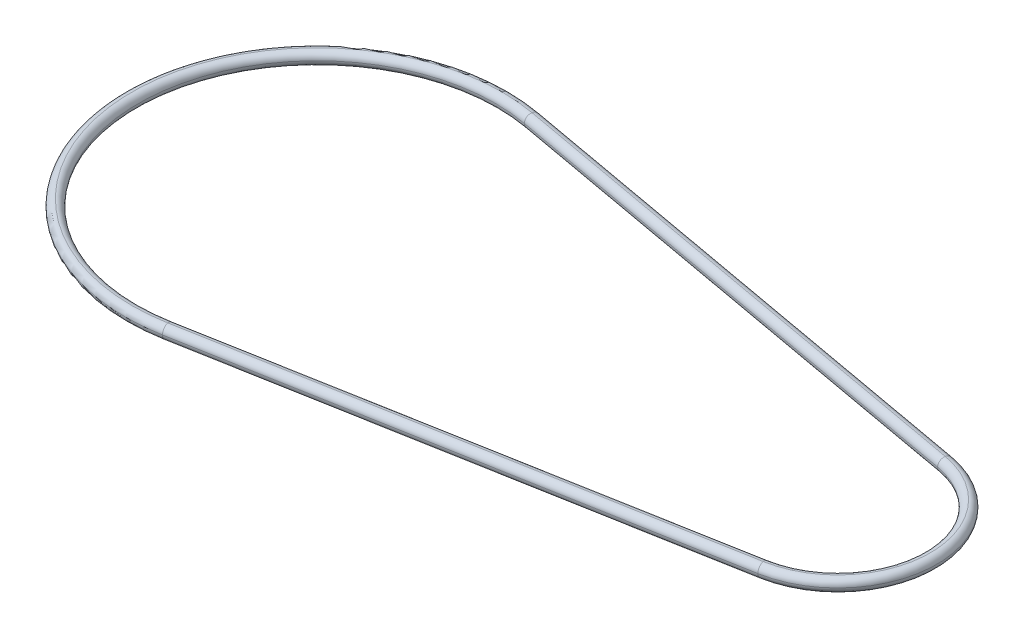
ISO-10303-21;
HEADER;
FILE_DESCRIPTION(('STEP AP214'),'2;1');
FILE_NAME('part.step','',(''),(''),'','','');
FILE_SCHEMA(('AUTOMOTIVE_DESIGN { 1 0 10303 214 1 1 1 1 }'));
ENDSEC;
DATA;
#1=APPLICATION_CONTEXT('core data for automotive mechanical design processes');
#2=APPLICATION_PROTOCOL_DEFINITION('international standard','automotive_design',2000,#1);
#3=PRODUCT_CONTEXT('',#1,'mechanical');
#4=PRODUCT('Part','Part','',(#3));
#5=PRODUCT_RELATED_PRODUCT_CATEGORY('part','',(#4));
#6=PRODUCT_DEFINITION_FORMATION('','',#4);
#7=PRODUCT_DEFINITION_CONTEXT('part definition',#1,'design');
#8=PRODUCT_DEFINITION('design','',#6,#7);
#9=PRODUCT_DEFINITION_SHAPE('','',#8);
#10=(LENGTH_UNIT() NAMED_UNIT(*) SI_UNIT(.MILLI.,.METRE.));
#11=(NAMED_UNIT(*) PLANE_ANGLE_UNIT() SI_UNIT($,.RADIAN.));
#12=(NAMED_UNIT(*) SI_UNIT($,.STERADIAN.) SOLID_ANGLE_UNIT());
#13=UNCERTAINTY_MEASURE_WITH_UNIT(LENGTH_MEASURE(1.E-05),#10,'distance_accuracy_value','');
#14=(GEOMETRIC_REPRESENTATION_CONTEXT(3) GLOBAL_UNCERTAINTY_ASSIGNED_CONTEXT((#13)) GLOBAL_UNIT_ASSIGNED_CONTEXT((#10,
#11,#12)) REPRESENTATION_CONTEXT('',''));
#15=CARTESIAN_POINT('',(0.,0.,0.));
#16=DIRECTION('',(0.,0.,1.));
#17=DIRECTION('',(1.,0.,0.));
#18=AXIS2_PLACEMENT_3D('',#15,#16,#17);
#19=CARTESIAN_POINT('',(0.,2.5,0.));
#20=DIRECTION('',(0.,1.,0.));
#21=DIRECTION('',(0.,0.,1.));
#22=AXIS2_PLACEMENT_3D('',#19,#20,#21);
#23=TOROIDAL_SURFACE('',#22,70.,2.5);
#24=CARTESIAN_POINT('',(12.4365482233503,2.5,68.8863721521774));
#25=DIRECTION('',(0.984091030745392,0.,-0.177664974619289));
#26=DIRECTION('',(-0.177664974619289,0.,-0.984091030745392));
#27=AXIS2_PLACEMENT_3D('',#24,#25,#26);
#28=CIRCLE('',#27,2.5);
#29=CARTESIAN_POINT('',(11.992385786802,2.5,66.426144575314));
#30=VERTEX_POINT('',#29);
#31=CARTESIAN_POINT('',(12.4365482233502,5.,68.8863721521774));
#32=VERTEX_POINT('',#31);
#33=EDGE_CURVE('E11',#30,#32,#28,.T.);
#34=ORIENTED_EDGE('',*,*,#33,.F.);
#35=CARTESIAN_POINT('',(0.,2.5,0.));
#36=DIRECTION('',(0.,1.,0.));
#37=DIRECTION('',(0.,0.,1.));
#38=AXIS2_PLACEMENT_3D('',#35,#36,#37);
#39=CIRCLE('',#38,67.5);
#40=CARTESIAN_POINT('',(11.992385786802,2.5,-66.4261445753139));
#41=VERTEX_POINT('',#40);
#42=EDGE_CURVE('E185',#41,#30,#39,.T.);
#43=ORIENTED_EDGE('',*,*,#42,.F.);
#44=CARTESIAN_POINT('',(12.4365482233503,2.5,-68.8863721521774));
#45=DIRECTION('',(0.984091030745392,0.,0.177664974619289));
#46=DIRECTION('',(0.177664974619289,0.,-0.984091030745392));
#47=AXIS2_PLACEMENT_3D('',#44,#45,#46);
#48=CIRCLE('',#47,2.5);
#49=CARTESIAN_POINT('',(12.4365482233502,5.,-68.8863721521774));
#50=VERTEX_POINT('',#49);
#51=EDGE_CURVE('E182',#50,#41,#48,.T.);
#52=ORIENTED_EDGE('',*,*,#51,.F.);
#53=CARTESIAN_POINT('',(0.,5.,0.));
#54=DIRECTION('',(0.,1.,0.));
#55=DIRECTION('',(0.,0.,1.));
#56=AXIS2_PLACEMENT_3D('',#53,#54,#55);
#57=CIRCLE('',#56,70.);
#58=EDGE_CURVE('E34',#32,#50,#57,.F.);
#59=ORIENTED_EDGE('',*,*,#58,.F.);
#60=EDGE_LOOP('',(#34,#43,#52,#59));
#61=FACE_BOUND('',#60,.T.);
#62=ADVANCED_FACE('F27',(#61),#23,.T.);
#63=CARTESIAN_POINT('',(12.4365482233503,2.5,68.8863721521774));
#64=DIRECTION('',(0.984091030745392,0.,-0.177664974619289));
#65=DIRECTION('',(-0.177664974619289,0.,-0.984091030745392));
#66=AXIS2_PLACEMENT_3D('',#63,#64,#65);
#67=CYLINDRICAL_SURFACE('',#66,2.5);
#68=DIRECTION('',(0.984091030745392,0.,-0.177664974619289));
#69=VECTOR('',#68,1.);
#70=CARTESIAN_POINT('',(11.992385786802,2.5,66.426144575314));
#71=LINE('',#70,#69);
#72=CARTESIAN_POINT('',(202.774111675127,2.5,31.9829584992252));
#73=VERTEX_POINT('',#72);
#74=EDGE_CURVE('E180',#30,#73,#71,.T.);
#75=ORIENTED_EDGE('',*,*,#74,.F.);
#76=ORIENTED_EDGE('',*,*,#33,.T.);
#77=DIRECTION('',(0.984091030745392,0.,-0.177664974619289));
#78=VECTOR('',#77,1.);
#79=CARTESIAN_POINT('',(12.4365482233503,5.,68.8863721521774));
#80=LINE('',#79,#78);
#81=CARTESIAN_POINT('',(203.218274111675,5.,34.4431860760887));
#82=VERTEX_POINT('',#81);
#83=EDGE_CURVE('E172',#82,#32,#80,.F.);
#84=ORIENTED_EDGE('',*,*,#83,.F.);
#85=CARTESIAN_POINT('',(203.218274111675,2.5,34.4431860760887));
#86=DIRECTION('',(0.984091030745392,0.,-0.177664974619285));
#87=DIRECTION('',(-0.177664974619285,0.,-0.984091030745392));
#88=AXIS2_PLACEMENT_3D('',#85,#86,#87);
#89=CIRCLE('',#88,2.5);
#90=EDGE_CURVE('E169',#73,#82,#89,.T.);
#91=ORIENTED_EDGE('',*,*,#90,.F.);
#92=EDGE_LOOP('',(#75,#76,#84,#91));
#93=FACE_BOUND('',#92,.T.);
#94=ADVANCED_FACE('F217',(#93),#67,.T.);
#95=CARTESIAN_POINT('',(0.,2.5,0.));
#96=DIRECTION('',(0.,1.,0.));
#97=DIRECTION('',(0.,0.,1.));
#98=AXIS2_PLACEMENT_3D('',#95,#96,#97);
#99=TOROIDAL_SURFACE('',#98,70.,2.5);
#100=CARTESIAN_POINT('',(12.4365482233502,2.5,68.8863721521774));
#101=DIRECTION('',(0.984091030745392,0.,-0.177664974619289));
#102=DIRECTION('',(-0.177664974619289,0.,-0.984091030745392));
#103=AXIS2_PLACEMENT_3D('',#100,#101,#102);
#104=CIRCLE('',#103,2.5);
#105=CARTESIAN_POINT('',(12.8807106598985,2.5,71.3465997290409));
#106=VERTEX_POINT('',#105);
#107=EDGE_CURVE('E175',#32,#106,#104,.T.);
#108=ORIENTED_EDGE('',*,*,#107,.F.);
#109=ORIENTED_EDGE('',*,*,#58,.T.);
#110=CARTESIAN_POINT('',(12.4365482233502,2.5,-68.8863721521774));
#111=DIRECTION('',(0.984091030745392,0.,0.177664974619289));
#112=DIRECTION('',(0.177664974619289,0.,-0.984091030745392));
#113=AXIS2_PLACEMENT_3D('',#110,#111,#112);
#114=CIRCLE('',#113,2.5);
#115=CARTESIAN_POINT('',(12.8807106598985,2.5,-71.3465997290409));
#116=VERTEX_POINT('',#115);
#117=EDGE_CURVE('E164',#116,#50,#114,.T.);
#118=ORIENTED_EDGE('',*,*,#117,.F.);
#119=CARTESIAN_POINT('',(0.,2.5,0.));
#120=DIRECTION('',(0.,1.,0.));
#121=DIRECTION('',(0.,0.,1.));
#122=AXIS2_PLACEMENT_3D('',#119,#120,#121);
#123=CIRCLE('',#122,72.5);
#124=EDGE_CURVE('E161',#106,#116,#123,.F.);
#125=ORIENTED_EDGE('',*,*,#124,.F.);
#126=EDGE_LOOP('',(#108,#109,#118,#125));
#127=FACE_BOUND('',#126,.T.);
#128=ADVANCED_FACE('F189',(#127),#99,.T.);
#129=CARTESIAN_POINT('',(0.,2.5,0.));
#130=DIRECTION('',(0.,1.,0.));
#131=DIRECTION('',(0.,0.,1.));
#132=AXIS2_PLACEMENT_3D('',#129,#130,#131);
#133=TOROIDAL_SURFACE('',#132,70.,2.5);
#134=CARTESIAN_POINT('',(12.4365482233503,2.5,-68.8863721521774));
#135=DIRECTION('',(0.984091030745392,0.,0.177664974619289));
#136=DIRECTION('',(0.177664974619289,0.,-0.984091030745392));
#137=AXIS2_PLACEMENT_3D('',#134,#135,#136);
#138=CIRCLE('',#137,2.5);
#139=CARTESIAN_POINT('',(12.4365482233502,0.,-68.8863721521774));
#140=VERTEX_POINT('',#139);
#141=EDGE_CURVE('E155',#41,#140,#138,.T.);
#142=ORIENTED_EDGE('',*,*,#141,.F.);
#143=ORIENTED_EDGE('',*,*,#42,.T.);
#144=CARTESIAN_POINT('',(12.4365482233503,2.5,68.8863721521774));
#145=DIRECTION('',(0.984091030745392,0.,-0.177664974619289));
#146=DIRECTION('',(-0.177664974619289,0.,-0.984091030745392));
#147=AXIS2_PLACEMENT_3D('',#144,#145,#146);
#148=CIRCLE('',#147,2.5);
#149=CARTESIAN_POINT('',(12.4365482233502,0.,68.8863721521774));
#150=VERTEX_POINT('',#149);
#151=EDGE_CURVE('E177',#150,#30,#148,.T.);
#152=ORIENTED_EDGE('',*,*,#151,.F.);
#153=CARTESIAN_POINT('',(0.,0.,0.));
#154=DIRECTION('',(0.,1.,0.));
#155=DIRECTION('',(0.,0.,1.));
#156=AXIS2_PLACEMENT_3D('',#153,#154,#155);
#157=CIRCLE('',#156,70.);
#158=EDGE_CURVE('E158',#140,#150,#157,.T.);
#159=ORIENTED_EDGE('',*,*,#158,.F.);
#160=EDGE_LOOP('',(#142,#143,#152,#159));
#161=FACE_BOUND('',#160,.T.);
#162=ADVANCED_FACE('F215',(#161),#133,.T.);
#163=CARTESIAN_POINT('',(12.4365482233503,2.5,-68.8863721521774));
#164=DIRECTION('',(-0.984091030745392,0.,-0.177664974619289));
#165=DIRECTION('',(-0.177664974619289,0.,0.984091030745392));
#166=AXIS2_PLACEMENT_3D('',#163,#164,#165);
#167=CYLINDRICAL_SURFACE('',#166,2.5);
#168=DIRECTION('',(-0.984091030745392,0.,-0.177664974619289));
#169=VECTOR('',#168,1.);
#170=CARTESIAN_POINT('',(12.4365482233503,5.,-68.8863721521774));
#171=LINE('',#170,#169);
#172=CARTESIAN_POINT('',(203.218274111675,5.,-34.4431860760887));
#173=VERTEX_POINT('',#172);
#174=EDGE_CURVE('E95',#50,#173,#171,.F.);
#175=ORIENTED_EDGE('',*,*,#174,.F.);
#176=ORIENTED_EDGE('',*,*,#51,.T.);
#177=DIRECTION('',(-0.984091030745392,0.,-0.177664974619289));
#178=VECTOR('',#177,1.);
#179=CARTESIAN_POINT('',(11.992385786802,2.5,-66.4261445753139));
#180=LINE('',#179,#178);
#181=CARTESIAN_POINT('',(202.774111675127,2.5,-31.9829584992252));
#182=VERTEX_POINT('',#181);
#183=EDGE_CURVE('E152',#182,#41,#180,.T.);
#184=ORIENTED_EDGE('',*,*,#183,.F.);
#185=CARTESIAN_POINT('',(203.218274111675,2.5,-34.4431860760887));
#186=DIRECTION('',(0.984091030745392,0.,0.177664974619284));
#187=DIRECTION('',(0.177664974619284,0.,-0.984091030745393));
#188=AXIS2_PLACEMENT_3D('',#185,#186,#187);
#189=CIRCLE('',#188,2.5);
#190=EDGE_CURVE('E167',#173,#182,#189,.T.);
#191=ORIENTED_EDGE('',*,*,#190,.F.);
#192=EDGE_LOOP('',(#175,#176,#184,#191));
#193=FACE_BOUND('',#192,.T.);
#194=ADVANCED_FACE('F194',(#193),#167,.T.);
#195=CARTESIAN_POINT('',(12.4365482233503,2.5,68.8863721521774));
#196=DIRECTION('',(-0.984091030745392,0.,0.177664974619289));
#197=DIRECTION('',(0.177664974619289,0.,0.984091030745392));
#198=AXIS2_PLACEMENT_3D('',#195,#196,#197);
#199=CYLINDRICAL_SURFACE('',#198,2.5);
#200=ORIENTED_EDGE('',*,*,#151,.T.);
#201=ORIENTED_EDGE('',*,*,#74,.T.);
#202=CARTESIAN_POINT('',(203.218274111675,2.5,34.4431860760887));
#203=DIRECTION('',(0.984091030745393,0.,-0.177664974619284));
#204=DIRECTION('',(-0.177664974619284,0.,-0.984091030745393));
#205=AXIS2_PLACEMENT_3D('',#202,#203,#204);
#206=CIRCLE('',#205,2.5);
#207=CARTESIAN_POINT('',(203.218274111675,0.,34.4431860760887));
#208=VERTEX_POINT('',#207);
#209=EDGE_CURVE('E144',#208,#73,#206,.T.);
#210=ORIENTED_EDGE('',*,*,#209,.F.);
#211=DIRECTION('',(0.984091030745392,0.,-0.177664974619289));
#212=VECTOR('',#211,1.);
#213=CARTESIAN_POINT('',(203.218274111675,0.,34.4431860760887));
#214=LINE('',#213,#212);
#215=EDGE_CURVE('E141',#150,#208,#214,.T.);
#216=ORIENTED_EDGE('',*,*,#215,.F.);
#217=EDGE_LOOP('',(#200,#201,#210,#216));
#218=FACE_BOUND('',#217,.T.);
#219=ADVANCED_FACE('F216',(#218),#199,.T.);
#220=CARTESIAN_POINT('',(12.4365482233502,2.5,68.8863721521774));
#221=DIRECTION('',(-0.984091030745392,0.,0.177664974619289));
#222=DIRECTION('',(0.177664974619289,0.,0.984091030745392));
#223=AXIS2_PLACEMENT_3D('',#220,#221,#222);
#224=CYLINDRICAL_SURFACE('',#223,2.5);
#225=ORIENTED_EDGE('',*,*,#83,.T.);
#226=ORIENTED_EDGE('',*,*,#107,.T.);
#227=DIRECTION('',(0.984091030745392,0.,-0.177664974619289));
#228=VECTOR('',#227,1.);
#229=CARTESIAN_POINT('',(12.8807106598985,2.5,71.3465997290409));
#230=LINE('',#229,#228);
#231=CARTESIAN_POINT('',(203.662436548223,2.5,36.9034136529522));
#232=VERTEX_POINT('',#231);
#233=EDGE_CURVE('E135',#232,#106,#230,.F.);
#234=ORIENTED_EDGE('',*,*,#233,.F.);
#235=CARTESIAN_POINT('',(203.218274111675,2.5,34.4431860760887));
#236=DIRECTION('',(0.984091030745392,0.,-0.177664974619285));
#237=DIRECTION('',(-0.177664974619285,0.,-0.984091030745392));
#238=AXIS2_PLACEMENT_3D('',#235,#236,#237);
#239=CIRCLE('',#238,2.5);
#240=EDGE_CURVE('E116',#82,#232,#239,.T.);
#241=ORIENTED_EDGE('',*,*,#240,.F.);
#242=EDGE_LOOP('',(#225,#226,#234,#241));
#243=FACE_BOUND('',#242,.T.);
#244=ADVANCED_FACE('F201',(#243),#224,.T.);
#245=CARTESIAN_POINT('',(197.,2.5,0.));
#246=DIRECTION('',(0.,1.,0.));
#247=DIRECTION('',(0.,0.,1.));
#248=AXIS2_PLACEMENT_3D('',#245,#246,#247);
#249=TOROIDAL_SURFACE('',#248,35.,2.5);
#250=CARTESIAN_POINT('',(197.,2.5,0.));
#251=DIRECTION('',(0.,1.,0.));
#252=DIRECTION('',(0.,0.,1.));
#253=AXIS2_PLACEMENT_3D('',#250,#251,#252);
#254=CIRCLE('',#253,32.5);
#255=EDGE_CURVE('E147',#73,#182,#254,.T.);
#256=ORIENTED_EDGE('',*,*,#255,.F.);
#257=ORIENTED_EDGE('',*,*,#90,.T.);
#258=CARTESIAN_POINT('',(197.,5.,0.));
#259=DIRECTION('',(0.,1.,0.));
#260=DIRECTION('',(0.,0.,1.));
#261=AXIS2_PLACEMENT_3D('',#258,#259,#260);
#262=CIRCLE('',#261,35.);
#263=EDGE_CURVE('E100',#173,#82,#262,.F.);
#264=ORIENTED_EDGE('',*,*,#263,.F.);
#265=ORIENTED_EDGE('',*,*,#190,.T.);
#266=EDGE_LOOP('',(#256,#257,#264,#265));
#267=FACE_BOUND('',#266,.T.);
#268=ADVANCED_FACE('F198',(#267),#249,.T.);
#269=CARTESIAN_POINT('',(12.4365482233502,2.5,-68.8863721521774));
#270=DIRECTION('',(0.984091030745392,0.,0.177664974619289));
#271=DIRECTION('',(0.177664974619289,0.,-0.984091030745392));
#272=AXIS2_PLACEMENT_3D('',#269,#270,#271);
#273=CYLINDRICAL_SURFACE('',#272,2.5);
#274=ORIENTED_EDGE('',*,*,#117,.T.);
#275=ORIENTED_EDGE('',*,*,#174,.T.);
#276=CARTESIAN_POINT('',(203.218274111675,2.5,-34.4431860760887));
#277=DIRECTION('',(0.984091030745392,0.,0.177664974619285));
#278=DIRECTION('',(0.177664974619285,0.,-0.984091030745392));
#279=AXIS2_PLACEMENT_3D('',#276,#277,#278);
#280=CIRCLE('',#279,2.5);
#281=CARTESIAN_POINT('',(203.662436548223,2.5,-36.9034136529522));
#282=VERTEX_POINT('',#281);
#283=EDGE_CURVE('E88',#282,#173,#280,.T.);
#284=ORIENTED_EDGE('',*,*,#283,.F.);
#285=DIRECTION('',(-0.984091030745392,0.,-0.177664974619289));
#286=VECTOR('',#285,1.);
#287=CARTESIAN_POINT('',(203.662436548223,2.5,-36.9034136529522));
#288=LINE('',#287,#286);
#289=EDGE_CURVE('E92',#116,#282,#288,.F.);
#290=ORIENTED_EDGE('',*,*,#289,.F.);
#291=EDGE_LOOP('',(#274,#275,#284,#290));
#292=FACE_BOUND('',#291,.T.);
#293=ADVANCED_FACE('F91',(#292),#273,.T.);
#294=CARTESIAN_POINT('',(0.,2.5,0.));
#295=DIRECTION('',(0.,1.,0.));
#296=DIRECTION('',(0.,0.,1.));
#297=AXIS2_PLACEMENT_3D('',#294,#295,#296);
#298=TOROIDAL_SURFACE('',#297,70.,2.5);
#299=CARTESIAN_POINT('',(12.4365482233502,2.5,-68.8863721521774));
#300=DIRECTION('',(0.984091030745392,0.,0.177664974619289));
#301=DIRECTION('',(0.177664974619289,0.,-0.984091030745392));
#302=AXIS2_PLACEMENT_3D('',#299,#300,#301);
#303=CIRCLE('',#302,2.5);
#304=EDGE_CURVE('E109',#140,#116,#303,.T.);
#305=ORIENTED_EDGE('',*,*,#304,.F.);
#306=ORIENTED_EDGE('',*,*,#158,.T.);
#307=CARTESIAN_POINT('',(12.4365482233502,2.5,68.8863721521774));
#308=DIRECTION('',(0.984091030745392,0.,-0.177664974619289));
#309=DIRECTION('',(-0.177664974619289,0.,-0.984091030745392));
#310=AXIS2_PLACEMENT_3D('',#307,#308,#309);
#311=CIRCLE('',#310,2.5);
#312=EDGE_CURVE('E138',#106,#150,#311,.T.);
#313=ORIENTED_EDGE('',*,*,#312,.F.);
#314=ORIENTED_EDGE('',*,*,#124,.T.);
#315=EDGE_LOOP('',(#305,#306,#313,#314));
#316=FACE_BOUND('',#315,.T.);
#317=ADVANCED_FACE('F214',(#316),#298,.T.);
#318=CARTESIAN_POINT('',(12.4365482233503,2.5,-68.8863721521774));
#319=DIRECTION('',(0.984091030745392,0.,0.177664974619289));
#320=DIRECTION('',(0.177664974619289,0.,-0.984091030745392));
#321=AXIS2_PLACEMENT_3D('',#318,#319,#320);
#322=CYLINDRICAL_SURFACE('',#321,2.5);
#323=CARTESIAN_POINT('',(203.218274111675,2.5,-34.4431860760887));
#324=DIRECTION('',(0.984091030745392,0.,0.177664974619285));
#325=DIRECTION('',(0.177664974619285,0.,-0.984091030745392));
#326=AXIS2_PLACEMENT_3D('',#323,#324,#325);
#327=CIRCLE('',#326,2.5);
#328=CARTESIAN_POINT('',(203.218274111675,0.,-34.4431860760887));
#329=VERTEX_POINT('',#328);
#330=EDGE_CURVE('E150',#182,#329,#327,.T.);
#331=ORIENTED_EDGE('',*,*,#330,.F.);
#332=ORIENTED_EDGE('',*,*,#183,.T.);
#333=ORIENTED_EDGE('',*,*,#141,.T.);
#334=DIRECTION('',(-0.984091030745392,0.,-0.177664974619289));
#335=VECTOR('',#334,1.);
#336=CARTESIAN_POINT('',(12.4365482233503,0.,-68.8863721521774));
#337=LINE('',#336,#335);
#338=EDGE_CURVE('E130',#329,#140,#337,.T.);
#339=ORIENTED_EDGE('',*,*,#338,.F.);
#340=EDGE_LOOP('',(#331,#332,#333,#339));
#341=FACE_BOUND('',#340,.T.);
#342=ADVANCED_FACE('F211',(#341),#322,.T.);
#343=CARTESIAN_POINT('',(197.,2.5,0.));
#344=DIRECTION('',(0.,1.,0.));
#345=DIRECTION('',(0.,0.,1.));
#346=AXIS2_PLACEMENT_3D('',#343,#344,#345);
#347=TOROIDAL_SURFACE('',#346,35.,2.5);
#348=ORIENTED_EDGE('',*,*,#255,.T.);
#349=ORIENTED_EDGE('',*,*,#330,.T.);
#350=CARTESIAN_POINT('',(197.,0.,0.));
#351=DIRECTION('',(0.,1.,0.));
#352=DIRECTION('',(0.,0.,1.));
#353=AXIS2_PLACEMENT_3D('',#350,#351,#352);
#354=CIRCLE('',#353,35.);
#355=EDGE_CURVE('E125',#208,#329,#354,.T.);
#356=ORIENTED_EDGE('',*,*,#355,.F.);
#357=ORIENTED_EDGE('',*,*,#209,.T.);
#358=EDGE_LOOP('',(#348,#349,#356,#357));
#359=FACE_BOUND('',#358,.T.);
#360=ADVANCED_FACE('F208',(#359),#347,.T.);
#361=CARTESIAN_POINT('',(12.4365482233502,2.5,68.8863721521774));
#362=DIRECTION('',(0.984091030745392,0.,-0.177664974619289));
#363=DIRECTION('',(-0.177664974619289,0.,-0.984091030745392));
#364=AXIS2_PLACEMENT_3D('',#361,#362,#363);
#365=CYLINDRICAL_SURFACE('',#364,2.5);
#366=ORIENTED_EDGE('',*,*,#312,.T.);
#367=ORIENTED_EDGE('',*,*,#215,.T.);
#368=CARTESIAN_POINT('',(203.218274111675,2.5,34.4431860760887));
#369=DIRECTION('',(0.984091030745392,0.,-0.177664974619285));
#370=DIRECTION('',(-0.177664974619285,0.,-0.984091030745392));
#371=AXIS2_PLACEMENT_3D('',#368,#369,#370);
#372=CIRCLE('',#371,2.5);
#373=EDGE_CURVE('E120',#232,#208,#372,.T.);
#374=ORIENTED_EDGE('',*,*,#373,.F.);
#375=ORIENTED_EDGE('',*,*,#233,.T.);
#376=EDGE_LOOP('',(#366,#367,#374,#375));
#377=FACE_BOUND('',#376,.T.);
#378=ADVANCED_FACE('F203',(#377),#365,.T.);
#379=CARTESIAN_POINT('',(197.,2.5,0.));
#380=DIRECTION('',(0.,1.,0.));
#381=DIRECTION('',(0.,0.,1.));
#382=AXIS2_PLACEMENT_3D('',#379,#380,#381);
#383=TOROIDAL_SURFACE('',#382,35.,2.5);
#384=ORIENTED_EDGE('',*,*,#263,.T.);
#385=ORIENTED_EDGE('',*,*,#240,.T.);
#386=CARTESIAN_POINT('',(197.,2.5,0.));
#387=DIRECTION('',(0.,1.,0.));
#388=DIRECTION('',(0.,0.,1.));
#389=AXIS2_PLACEMENT_3D('',#386,#387,#388);
#390=CIRCLE('',#389,37.5);
#391=EDGE_CURVE('E113',#282,#232,#390,.F.);
#392=ORIENTED_EDGE('',*,*,#391,.F.);
#393=ORIENTED_EDGE('',*,*,#283,.T.);
#394=EDGE_LOOP('',(#384,#385,#392,#393));
#395=FACE_BOUND('',#394,.T.);
#396=ADVANCED_FACE('F114',(#395),#383,.T.);
#397=CARTESIAN_POINT('',(12.4365482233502,2.5,-68.8863721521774));
#398=DIRECTION('',(-0.984091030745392,0.,-0.177664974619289));
#399=DIRECTION('',(-0.177664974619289,0.,0.984091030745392));
#400=AXIS2_PLACEMENT_3D('',#397,#398,#399);
#401=CYLINDRICAL_SURFACE('',#400,2.5);
#402=ORIENTED_EDGE('',*,*,#304,.T.);
#403=ORIENTED_EDGE('',*,*,#289,.T.);
#404=CARTESIAN_POINT('',(203.218274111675,2.5,-34.4431860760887));
#405=DIRECTION('',(0.984091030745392,0.,0.177664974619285));
#406=DIRECTION('',(0.177664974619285,0.,-0.984091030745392));
#407=AXIS2_PLACEMENT_3D('',#404,#405,#406);
#408=CIRCLE('',#407,2.5);
#409=EDGE_CURVE('E107',#329,#282,#408,.T.);
#410=ORIENTED_EDGE('',*,*,#409,.F.);
#411=ORIENTED_EDGE('',*,*,#338,.T.);
#412=EDGE_LOOP('',(#402,#403,#410,#411));
#413=FACE_BOUND('',#412,.T.);
#414=ADVANCED_FACE('F104',(#413),#401,.T.);
#415=CARTESIAN_POINT('',(197.,2.5,0.));
#416=DIRECTION('',(0.,1.,0.));
#417=DIRECTION('',(0.,0.,1.));
#418=AXIS2_PLACEMENT_3D('',#415,#416,#417);
#419=TOROIDAL_SURFACE('',#418,35.,2.5);
#420=ORIENTED_EDGE('',*,*,#373,.T.);
#421=ORIENTED_EDGE('',*,*,#355,.T.);
#422=ORIENTED_EDGE('',*,*,#409,.T.);
#423=ORIENTED_EDGE('',*,*,#391,.T.);
#424=EDGE_LOOP('',(#420,#421,#422,#423));
#425=FACE_BOUND('',#424,.T.);
#426=ADVANCED_FACE('F123',(#425),#419,.T.);
#427=CLOSED_SHELL('',(#62,#94,#128,#162,#194,#219,#244,#268,#293,#317,#342,#360,#378,#396,#414,#426));
#428=MANIFOLD_SOLID_BREP('B2',#427);
#429=ADVANCED_BREP_SHAPE_REPRESENTATION('',(#18,#428),#14);
#430=SHAPE_DEFINITION_REPRESENTATION(#9,#429);
ENDSEC;
END-ISO-10303-21;
